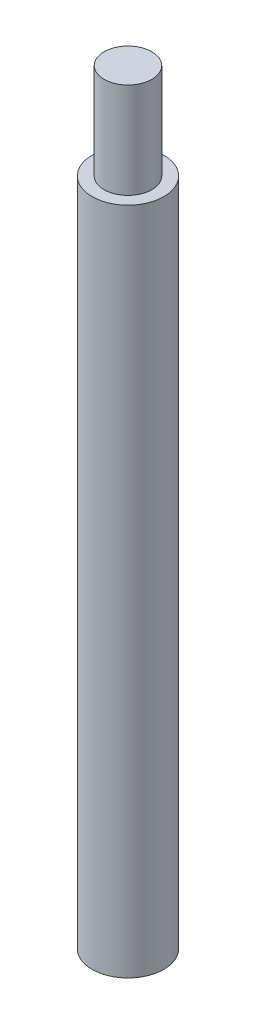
from build123d import *

# Parameters (mm, degrees)
SZKIC1_R                    = 7.5
SZKIC1_R_2                  = 5
DODANIE_WYCI_GNI_CIE1_DEPTH = 140
DODANIE_WYCI_GNI_CIE2_START = 10
SZKIC1_2_R                  = 5
DODANIE_WYCI_GNI_CIE2_DEPTH = 150


with BuildPart() as part:
    # Szkic1 → Dodanie-wyci_gni_cie1 (new body)
    with BuildSketch(Plane(origin=(0, 0, 0), x_dir=(1, 0, 0), z_dir=(0, 1, 0))):
        with Locations(Location((0, 0, 0), (0, 0, 270))):
            Circle(SZKIC1_R)
        with Locations(Location((0, 0, 0), (0, 0, 270))):
            Circle(SZKIC1_R_2, mode=Mode.SUBTRACT)
    extrude(amount=DODANIE_WYCI_GNI_CIE1_DEPTH)

    # Szkic1_2 → Dodanie-wyci_gni_cie2 (add)
    with BuildSketch(Plane(origin=(0, 0, 0), x_dir=(1, 0, 0), z_dir=(0, 1, 0)).offset(DODANIE_WYCI_GNI_CIE2_START)):
        with Locations(Location((0, 0, 0), (0, 0, 270))):
            Circle(SZKIC1_2_R)
    extrude(amount=DODANIE_WYCI_GNI_CIE2_DEPTH)


solid = part.part
